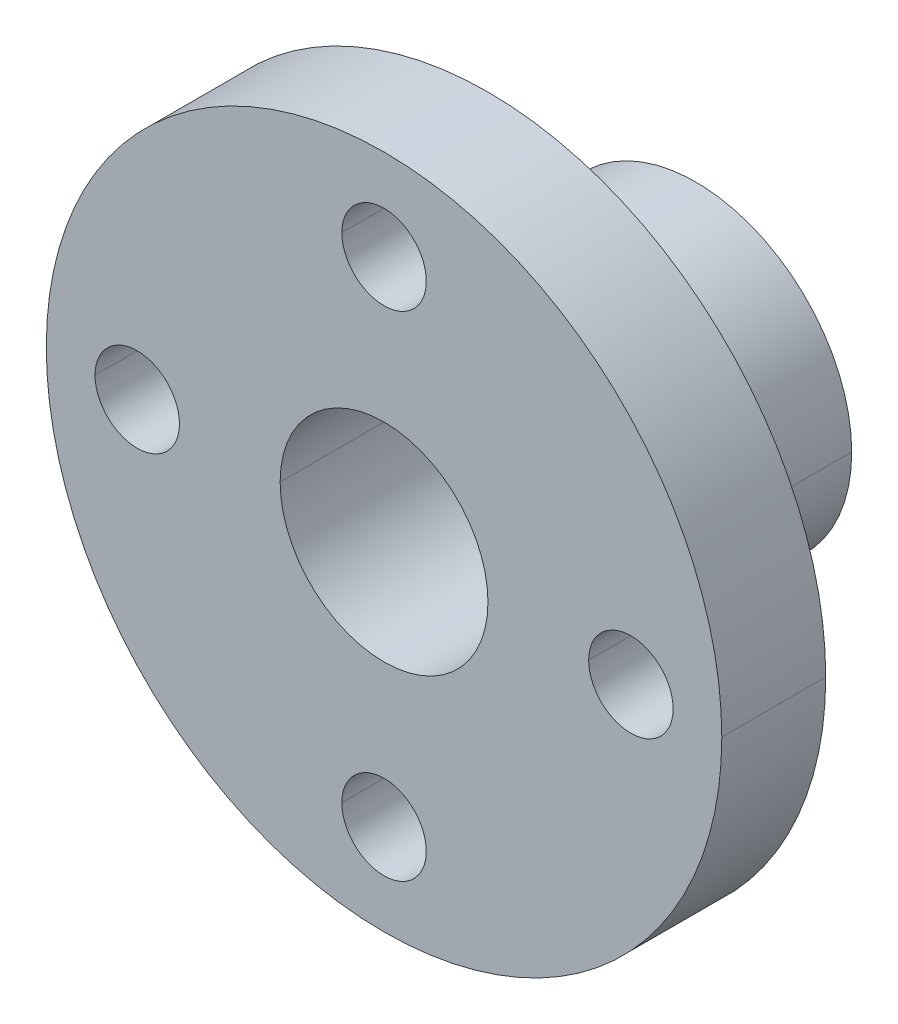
ISO-10303-21;
HEADER;
FILE_DESCRIPTION(('STEP AP214'),'2;1');
FILE_NAME('part.step','',(''),(''),'','','');
FILE_SCHEMA(('AUTOMOTIVE_DESIGN { 1 0 10303 214 1 1 1 1 }'));
ENDSEC;
DATA;
#1=APPLICATION_CONTEXT('core data for automotive mechanical design processes');
#2=APPLICATION_PROTOCOL_DEFINITION('international standard','automotive_design',2000,#1);
#3=PRODUCT_CONTEXT('',#1,'mechanical');
#4=PRODUCT('Part','Part','',(#3));
#5=PRODUCT_RELATED_PRODUCT_CATEGORY('part','',(#4));
#6=PRODUCT_DEFINITION_FORMATION('','',#4);
#7=PRODUCT_DEFINITION_CONTEXT('part definition',#1,'design');
#8=PRODUCT_DEFINITION('design','',#6,#7);
#9=PRODUCT_DEFINITION_SHAPE('','',#8);
#10=(LENGTH_UNIT() NAMED_UNIT(*) SI_UNIT(.MILLI.,.METRE.));
#11=(NAMED_UNIT(*) PLANE_ANGLE_UNIT() SI_UNIT($,.RADIAN.));
#12=(NAMED_UNIT(*) SI_UNIT($,.STERADIAN.) SOLID_ANGLE_UNIT());
#13=UNCERTAINTY_MEASURE_WITH_UNIT(LENGTH_MEASURE(1.E-05),#10,'distance_accuracy_value','');
#14=(GEOMETRIC_REPRESENTATION_CONTEXT(3) GLOBAL_UNCERTAINTY_ASSIGNED_CONTEXT((#13)) GLOBAL_UNIT_ASSIGNED_CONTEXT((#10,
#11,#12)) REPRESENTATION_CONTEXT('',''));
#15=CARTESIAN_POINT('',(0.,0.,0.));
#16=DIRECTION('',(0.,0.,1.));
#17=DIRECTION('',(1.,0.,0.));
#18=AXIS2_PLACEMENT_3D('',#15,#16,#17);
#19=CARTESIAN_POINT('',(0.,0.,-6.35000000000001));
#20=DIRECTION('',(0.,0.,-1.));
#21=DIRECTION('',(0.,1.,0.));
#22=AXIS2_PLACEMENT_3D('',#19,#20,#21);
#23=CYLINDRICAL_SURFACE('',#22,19.05);
#24=DIRECTION('',(0.,0.,-1.));
#25=VECTOR('',#24,1.);
#26=CARTESIAN_POINT('',(19.05,0.,-6.35000000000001));
#27=LINE('',#26,#25);
#28=CARTESIAN_POINT('',(19.05,0.,6.34999999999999));
#29=VERTEX_POINT('',#28);
#30=CARTESIAN_POINT('',(19.05,0.,-19.05));
#31=VERTEX_POINT('',#30);
#32=EDGE_CURVE('E117',#29,#31,#27,.T.);
#33=ORIENTED_EDGE('',*,*,#32,.F.);
#34=CARTESIAN_POINT('',(0.,0.,6.34999999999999));
#35=DIRECTION('',(0.,0.,-1.));
#36=DIRECTION('',(0.,1.,0.));
#37=AXIS2_PLACEMENT_3D('',#34,#35,#36);
#38=CIRCLE('',#37,19.05);
#39=CARTESIAN_POINT('',(-19.05,0.,6.34999999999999));
#40=VERTEX_POINT('',#39);
#41=EDGE_CURVE('E130',#40,#29,#38,.F.);
#42=ORIENTED_EDGE('',*,*,#41,.F.);
#43=DIRECTION('',(0.,0.,-1.));
#44=VECTOR('',#43,1.);
#45=CARTESIAN_POINT('',(-19.05,0.,-6.35000000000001));
#46=LINE('',#45,#44);
#47=CARTESIAN_POINT('',(-19.05,0.,-19.05));
#48=VERTEX_POINT('',#47);
#49=EDGE_CURVE('E113',#48,#40,#46,.F.);
#50=ORIENTED_EDGE('',*,*,#49,.F.);
#51=CARTESIAN_POINT('',(0.,0.,-19.05));
#52=DIRECTION('',(0.,0.,-1.));
#53=DIRECTION('',(0.,1.,0.));
#54=AXIS2_PLACEMENT_3D('',#51,#52,#53);
#55=CIRCLE('',#54,19.05);
#56=EDGE_CURVE('E19',#48,#31,#55,.F.);
#57=ORIENTED_EDGE('',*,*,#56,.T.);
#58=EDGE_LOOP('',(#33,#42,#50,#57));
#59=FACE_BOUND('',#58,.T.);
#60=ADVANCED_FACE('F16',(#59),#23,.T.);
#61=CARTESIAN_POINT('',(0.,0.,-6.35000000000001));
#62=DIRECTION('',(0.,0.,-1.));
#63=DIRECTION('',(0.,1.,0.));
#64=AXIS2_PLACEMENT_3D('',#61,#62,#63);
#65=CYLINDRICAL_SURFACE('',#64,19.05);
#66=ORIENTED_EDGE('',*,*,#32,.T.);
#67=CARTESIAN_POINT('',(0.,0.,-19.05));
#68=DIRECTION('',(0.,0.,-1.));
#69=DIRECTION('',(0.,1.,0.));
#70=AXIS2_PLACEMENT_3D('',#67,#68,#69);
#71=CIRCLE('',#70,19.05);
#72=EDGE_CURVE('E121',#31,#48,#71,.F.);
#73=ORIENTED_EDGE('',*,*,#72,.T.);
#74=ORIENTED_EDGE('',*,*,#49,.T.);
#75=CARTESIAN_POINT('',(0.,0.,6.34999999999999));
#76=DIRECTION('',(0.,0.,-1.));
#77=DIRECTION('',(0.,1.,0.));
#78=AXIS2_PLACEMENT_3D('',#75,#76,#77);
#79=CIRCLE('',#78,19.05);
#80=EDGE_CURVE('E125',#29,#40,#79,.F.);
#81=ORIENTED_EDGE('',*,*,#80,.F.);
#82=EDGE_LOOP('',(#66,#73,#74,#81));
#83=FACE_BOUND('',#82,.T.);
#84=ADVANCED_FACE('F123',(#83),#65,.T.);
#85=CARTESIAN_POINT('',(0.,0.,-19.05));
#86=DIRECTION('',(0.,0.,1.));
#87=DIRECTION('',(0.,-1.,0.));
#88=AXIS2_PLACEMENT_3D('',#85,#86,#87);
#89=PLANE('',#88);
#90=ORIENTED_EDGE('',*,*,#56,.F.);
#91=ORIENTED_EDGE('',*,*,#72,.F.);
#92=EDGE_LOOP('',(#90,#91));
#93=FACE_BOUND('',#92,.T.);
#94=CARTESIAN_POINT('',(0.,0.,-19.05));
#95=DIRECTION('',(0.,0.,1.));
#96=DIRECTION('',(0.,-1.,0.));
#97=AXIS2_PLACEMENT_3D('',#94,#95,#96);
#98=CIRCLE('',#97,12.7);
#99=CARTESIAN_POINT('',(-12.7,0.,-19.05));
#100=VERTEX_POINT('',#99);
#101=CARTESIAN_POINT('',(12.7,0.,-19.05));
#102=VERTEX_POINT('',#101);
#103=EDGE_CURVE('E137',#100,#102,#98,.T.);
#104=ORIENTED_EDGE('',*,*,#103,.T.);
#105=CARTESIAN_POINT('',(0.,0.,-19.05));
#106=DIRECTION('',(0.,0.,1.));
#107=DIRECTION('',(0.,-1.,0.));
#108=AXIS2_PLACEMENT_3D('',#105,#106,#107);
#109=CIRCLE('',#108,12.7);
#110=EDGE_CURVE('E134',#102,#100,#109,.T.);
#111=ORIENTED_EDGE('',*,*,#110,.T.);
#112=EDGE_LOOP('',(#104,#111));
#113=FACE_BOUND('',#112,.T.);
#114=ADVANCED_FACE('F128',(#93,#113),#89,.F.);
#115=CARTESIAN_POINT('',(0.,0.,6.34999999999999));
#116=DIRECTION('',(0.,0.,-1.));
#117=DIRECTION('',(0.,1.,0.));
#118=AXIS2_PLACEMENT_3D('',#115,#116,#117);
#119=PLANE('',#118);
#120=ORIENTED_EDGE('',*,*,#41,.T.);
#121=ORIENTED_EDGE('',*,*,#80,.T.);
#122=EDGE_LOOP('',(#120,#121));
#123=FACE_BOUND('',#122,.T.);
#124=CARTESIAN_POINT('',(0.,0.,6.34999999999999));
#125=DIRECTION('',(0.,0.,1.));
#126=DIRECTION('',(0.,-1.,0.));
#127=AXIS2_PLACEMENT_3D('',#124,#125,#126);
#128=CIRCLE('',#127,41.275);
#129=CARTESIAN_POINT('',(-41.275,0.,6.34999999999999));
#130=VERTEX_POINT('',#129);
#131=CARTESIAN_POINT('',(41.275,0.,6.34999999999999));
#132=VERTEX_POINT('',#131);
#133=EDGE_CURVE('E167',#130,#132,#128,.T.);
#134=ORIENTED_EDGE('',*,*,#133,.F.);
#135=CARTESIAN_POINT('',(0.,0.,6.34999999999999));
#136=DIRECTION('',(0.,0.,1.));
#137=DIRECTION('',(0.,-1.,0.));
#138=AXIS2_PLACEMENT_3D('',#135,#136,#137);
#139=CIRCLE('',#138,41.275);
#140=EDGE_CURVE('E163',#132,#130,#139,.T.);
#141=ORIENTED_EDGE('',*,*,#140,.F.);
#142=EDGE_LOOP('',(#134,#141));
#143=FACE_BOUND('',#142,.T.);
#144=CARTESIAN_POINT('',(-30.1625,0.,6.34999999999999));
#145=DIRECTION('',(0.,0.,1.));
#146=DIRECTION('',(0.,-1.,0.));
#147=AXIS2_PLACEMENT_3D('',#144,#145,#146);
#148=CIRCLE('',#147,5.159375);
#149=CARTESIAN_POINT('',(-25.003125,0.,6.34999999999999));
#150=VERTEX_POINT('',#149);
#151=CARTESIAN_POINT('',(-35.321875,0.,6.34999999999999));
#152=VERTEX_POINT('',#151);
#153=EDGE_CURVE('E159',#150,#152,#148,.T.);
#154=ORIENTED_EDGE('',*,*,#153,.T.);
#155=CARTESIAN_POINT('',(-30.1625,0.,6.34999999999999));
#156=DIRECTION('',(0.,0.,1.));
#157=DIRECTION('',(0.,-1.,0.));
#158=AXIS2_PLACEMENT_3D('',#155,#156,#157);
#159=CIRCLE('',#158,5.159375);
#160=EDGE_CURVE('E157',#152,#150,#159,.T.);
#161=ORIENTED_EDGE('',*,*,#160,.T.);
#162=EDGE_LOOP('',(#154,#161));
#163=FACE_BOUND('',#162,.T.);
#164=CARTESIAN_POINT('',(0.,-30.1625,6.34999999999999));
#165=DIRECTION('',(0.,0.,1.));
#166=DIRECTION('',(0.,-1.,0.));
#167=AXIS2_PLACEMENT_3D('',#164,#165,#166);
#168=CIRCLE('',#167,5.159375);
#169=CARTESIAN_POINT('',(5.159375,-30.1625,6.34999999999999));
#170=VERTEX_POINT('',#169);
#171=CARTESIAN_POINT('',(-5.159375,-30.1625,6.34999999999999));
#172=VERTEX_POINT('',#171);
#173=EDGE_CURVE('E153',#170,#172,#168,.T.);
#174=ORIENTED_EDGE('',*,*,#173,.T.);
#175=CARTESIAN_POINT('',(0.,-30.1625,6.34999999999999));
#176=DIRECTION('',(0.,0.,1.));
#177=DIRECTION('',(0.,-1.,0.));
#178=AXIS2_PLACEMENT_3D('',#175,#176,#177);
#179=CIRCLE('',#178,5.159375);
#180=EDGE_CURVE('E151',#172,#170,#179,.T.);
#181=ORIENTED_EDGE('',*,*,#180,.T.);
#182=EDGE_LOOP('',(#174,#181));
#183=FACE_BOUND('',#182,.T.);
#184=CARTESIAN_POINT('',(30.1625,0.,6.34999999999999));
#185=DIRECTION('',(0.,0.,1.));
#186=DIRECTION('',(0.,-1.,0.));
#187=AXIS2_PLACEMENT_3D('',#184,#185,#186);
#188=CIRCLE('',#187,5.159375);
#189=CARTESIAN_POINT('',(35.321875,0.,6.34999999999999));
#190=VERTEX_POINT('',#189);
#191=CARTESIAN_POINT('',(25.003125,0.,6.34999999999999));
#192=VERTEX_POINT('',#191);
#193=EDGE_CURVE('E147',#190,#192,#188,.T.);
#194=ORIENTED_EDGE('',*,*,#193,.T.);
#195=CARTESIAN_POINT('',(30.1625,0.,6.34999999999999));
#196=DIRECTION('',(0.,0.,1.));
#197=DIRECTION('',(0.,-1.,0.));
#198=AXIS2_PLACEMENT_3D('',#195,#196,#197);
#199=CIRCLE('',#198,5.159375);
#200=EDGE_CURVE('E145',#192,#190,#199,.T.);
#201=ORIENTED_EDGE('',*,*,#200,.T.);
#202=EDGE_LOOP('',(#194,#201));
#203=FACE_BOUND('',#202,.T.);
#204=CARTESIAN_POINT('',(0.,30.1625,6.34999999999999));
#205=DIRECTION('',(0.,0.,1.));
#206=DIRECTION('',(0.,-1.,0.));
#207=AXIS2_PLACEMENT_3D('',#204,#205,#206);
#208=CIRCLE('',#207,5.159375);
#209=CARTESIAN_POINT('',(5.159375,30.1625,6.34999999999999));
#210=VERTEX_POINT('',#209);
#211=CARTESIAN_POINT('',(-5.159375,30.1625,6.34999999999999));
#212=VERTEX_POINT('',#211);
#213=EDGE_CURVE('E142',#210,#212,#208,.T.);
#214=ORIENTED_EDGE('',*,*,#213,.T.);
#215=CARTESIAN_POINT('',(0.,30.1625,6.34999999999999));
#216=DIRECTION('',(0.,0.,1.));
#217=DIRECTION('',(0.,-1.,0.));
#218=AXIS2_PLACEMENT_3D('',#215,#216,#217);
#219=CIRCLE('',#218,5.159375);
#220=EDGE_CURVE('E140',#212,#210,#219,.T.);
#221=ORIENTED_EDGE('',*,*,#220,.T.);
#222=EDGE_LOOP('',(#214,#221));
#223=FACE_BOUND('',#222,.T.);
#224=ADVANCED_FACE('F330',(#123,#143,#163,#183,#203,#223),#119,.T.);
#225=CARTESIAN_POINT('',(0.,0.,19.05));
#226=DIRECTION('',(0.,0.,1.));
#227=DIRECTION('',(0.,-1.,0.));
#228=AXIS2_PLACEMENT_3D('',#225,#226,#227);
#229=CYLINDRICAL_SURFACE('',#228,12.7);
#230=CARTESIAN_POINT('',(0.,0.,19.05));
#231=DIRECTION('',(0.,0.,1.));
#232=DIRECTION('',(0.,-1.,0.));
#233=AXIS2_PLACEMENT_3D('',#230,#231,#232);
#234=CIRCLE('',#233,12.7);
#235=CARTESIAN_POINT('',(-12.7,0.,19.05));
#236=VERTEX_POINT('',#235);
#237=CARTESIAN_POINT('',(12.7,0.,19.05));
#238=VERTEX_POINT('',#237);
#239=EDGE_CURVE('E170',#236,#238,#234,.F.);
#240=ORIENTED_EDGE('',*,*,#239,.F.);
#241=DIRECTION('',(0.,0.,1.));
#242=VECTOR('',#241,1.);
#243=CARTESIAN_POINT('',(-12.7,0.,19.05));
#244=LINE('',#243,#242);
#245=EDGE_CURVE('E136',#236,#100,#244,.F.);
#246=ORIENTED_EDGE('',*,*,#245,.T.);
#247=ORIENTED_EDGE('',*,*,#110,.F.);
#248=DIRECTION('',(0.,0.,1.));
#249=VECTOR('',#248,1.);
#250=CARTESIAN_POINT('',(12.7,0.,19.05));
#251=LINE('',#250,#249);
#252=EDGE_CURVE('E139',#102,#238,#251,.T.);
#253=ORIENTED_EDGE('',*,*,#252,.T.);
#254=EDGE_LOOP('',(#240,#246,#247,#253));
#255=FACE_BOUND('',#254,.T.);
#256=ADVANCED_FACE('F322',(#255),#229,.F.);
#257=CARTESIAN_POINT('',(0.,0.,19.05));
#258=DIRECTION('',(0.,0.,1.));
#259=DIRECTION('',(0.,-1.,0.));
#260=AXIS2_PLACEMENT_3D('',#257,#258,#259);
#261=CYLINDRICAL_SURFACE('',#260,12.7);
#262=ORIENTED_EDGE('',*,*,#103,.F.);
#263=ORIENTED_EDGE('',*,*,#245,.F.);
#264=CARTESIAN_POINT('',(0.,0.,19.05));
#265=DIRECTION('',(0.,0.,1.));
#266=DIRECTION('',(0.,-1.,0.));
#267=AXIS2_PLACEMENT_3D('',#264,#265,#266);
#268=CIRCLE('',#267,12.7);
#269=EDGE_CURVE('E173',#238,#236,#268,.F.);
#270=ORIENTED_EDGE('',*,*,#269,.F.);
#271=ORIENTED_EDGE('',*,*,#252,.F.);
#272=EDGE_LOOP('',(#262,#263,#270,#271));
#273=FACE_BOUND('',#272,.T.);
#274=ADVANCED_FACE('F314',(#273),#261,.F.);
#275=CARTESIAN_POINT('',(0.,30.1625,12.7));
#276=DIRECTION('',(0.,0.,1.));
#277=DIRECTION('',(0.,-1.,0.));
#278=AXIS2_PLACEMENT_3D('',#275,#276,#277);
#279=CYLINDRICAL_SURFACE('',#278,5.159375);
#280=ORIENTED_EDGE('',*,*,#220,.F.);
#281=DIRECTION('',(0.,0.,1.));
#282=VECTOR('',#281,1.);
#283=CARTESIAN_POINT('',(-5.159375,30.1625,12.7));
#284=LINE('',#283,#282);
#285=CARTESIAN_POINT('',(-5.159375,30.1625,19.05));
#286=VERTEX_POINT('',#285);
#287=EDGE_CURVE('E144',#212,#286,#284,.T.);
#288=ORIENTED_EDGE('',*,*,#287,.T.);
#289=CARTESIAN_POINT('',(0.,30.1625,19.05));
#290=DIRECTION('',(0.,0.,1.));
#291=DIRECTION('',(0.,-1.,0.));
#292=AXIS2_PLACEMENT_3D('',#289,#290,#291);
#293=CIRCLE('',#292,5.159375);
#294=CARTESIAN_POINT('',(5.159375,30.1625,19.05));
#295=VERTEX_POINT('',#294);
#296=EDGE_CURVE('E176',#295,#286,#293,.F.);
#297=ORIENTED_EDGE('',*,*,#296,.F.);
#298=DIRECTION('',(0.,0.,1.));
#299=VECTOR('',#298,1.);
#300=CARTESIAN_POINT('',(5.159375,30.1625,12.7));
#301=LINE('',#300,#299);
#302=EDGE_CURVE('E148',#295,#210,#301,.F.);
#303=ORIENTED_EDGE('',*,*,#302,.T.);
#304=EDGE_LOOP('',(#280,#288,#297,#303));
#305=FACE_BOUND('',#304,.T.);
#306=ADVANCED_FACE('F306',(#305),#279,.F.);
#307=CARTESIAN_POINT('',(0.,30.1625,12.7));
#308=DIRECTION('',(0.,0.,1.));
#309=DIRECTION('',(0.,-1.,0.));
#310=AXIS2_PLACEMENT_3D('',#307,#308,#309);
#311=CYLINDRICAL_SURFACE('',#310,5.159375);
#312=CARTESIAN_POINT('',(0.,30.1625,19.05));
#313=DIRECTION('',(0.,0.,1.));
#314=DIRECTION('',(0.,-1.,0.));
#315=AXIS2_PLACEMENT_3D('',#312,#313,#314);
#316=CIRCLE('',#315,5.159375);
#317=EDGE_CURVE('E179',#286,#295,#316,.F.);
#318=ORIENTED_EDGE('',*,*,#317,.F.);
#319=ORIENTED_EDGE('',*,*,#287,.F.);
#320=ORIENTED_EDGE('',*,*,#213,.F.);
#321=ORIENTED_EDGE('',*,*,#302,.F.);
#322=EDGE_LOOP('',(#318,#319,#320,#321));
#323=FACE_BOUND('',#322,.T.);
#324=ADVANCED_FACE('F298',(#323),#311,.F.);
#325=CARTESIAN_POINT('',(30.1625,0.,12.7));
#326=DIRECTION('',(0.,0.,1.));
#327=DIRECTION('',(0.,-1.,0.));
#328=AXIS2_PLACEMENT_3D('',#325,#326,#327);
#329=CYLINDRICAL_SURFACE('',#328,5.159375);
#330=ORIENTED_EDGE('',*,*,#200,.F.);
#331=DIRECTION('',(0.,0.,1.));
#332=VECTOR('',#331,1.);
#333=CARTESIAN_POINT('',(25.003125,0.,12.7));
#334=LINE('',#333,#332);
#335=CARTESIAN_POINT('',(25.003125,0.,19.05));
#336=VERTEX_POINT('',#335);
#337=EDGE_CURVE('E150',#192,#336,#334,.T.);
#338=ORIENTED_EDGE('',*,*,#337,.T.);
#339=CARTESIAN_POINT('',(30.1625,0.,19.05));
#340=DIRECTION('',(0.,0.,1.));
#341=DIRECTION('',(0.,-1.,0.));
#342=AXIS2_PLACEMENT_3D('',#339,#340,#341);
#343=CIRCLE('',#342,5.159375);
#344=CARTESIAN_POINT('',(35.321875,0.,19.05));
#345=VERTEX_POINT('',#344);
#346=EDGE_CURVE('E182',#345,#336,#343,.F.);
#347=ORIENTED_EDGE('',*,*,#346,.F.);
#348=DIRECTION('',(0.,0.,1.));
#349=VECTOR('',#348,1.);
#350=CARTESIAN_POINT('',(35.321875,0.,12.7));
#351=LINE('',#350,#349);
#352=EDGE_CURVE('E154',#345,#190,#351,.F.);
#353=ORIENTED_EDGE('',*,*,#352,.T.);
#354=EDGE_LOOP('',(#330,#338,#347,#353));
#355=FACE_BOUND('',#354,.T.);
#356=ADVANCED_FACE('F290',(#355),#329,.F.);
#357=CARTESIAN_POINT('',(30.1625,0.,12.7));
#358=DIRECTION('',(0.,0.,1.));
#359=DIRECTION('',(0.,-1.,0.));
#360=AXIS2_PLACEMENT_3D('',#357,#358,#359);
#361=CYLINDRICAL_SURFACE('',#360,5.159375);
#362=CARTESIAN_POINT('',(30.1625,0.,19.05));
#363=DIRECTION('',(0.,0.,1.));
#364=DIRECTION('',(0.,-1.,0.));
#365=AXIS2_PLACEMENT_3D('',#362,#363,#364);
#366=CIRCLE('',#365,5.159375);
#367=EDGE_CURVE('E185',#336,#345,#366,.F.);
#368=ORIENTED_EDGE('',*,*,#367,.F.);
#369=ORIENTED_EDGE('',*,*,#337,.F.);
#370=ORIENTED_EDGE('',*,*,#193,.F.);
#371=ORIENTED_EDGE('',*,*,#352,.F.);
#372=EDGE_LOOP('',(#368,#369,#370,#371));
#373=FACE_BOUND('',#372,.T.);
#374=ADVANCED_FACE('F282',(#373),#361,.F.);
#375=CARTESIAN_POINT('',(0.,-30.1625,12.7));
#376=DIRECTION('',(0.,0.,1.));
#377=DIRECTION('',(0.,-1.,0.));
#378=AXIS2_PLACEMENT_3D('',#375,#376,#377);
#379=CYLINDRICAL_SURFACE('',#378,5.159375);
#380=ORIENTED_EDGE('',*,*,#180,.F.);
#381=DIRECTION('',(0.,0.,1.));
#382=VECTOR('',#381,1.);
#383=CARTESIAN_POINT('',(-5.159375,-30.1625,12.7));
#384=LINE('',#383,#382);
#385=CARTESIAN_POINT('',(-5.159375,-30.1625,19.05));
#386=VERTEX_POINT('',#385);
#387=EDGE_CURVE('E156',#172,#386,#384,.T.);
#388=ORIENTED_EDGE('',*,*,#387,.T.);
#389=CARTESIAN_POINT('',(0.,-30.1625,19.05));
#390=DIRECTION('',(0.,0.,1.));
#391=DIRECTION('',(0.,-1.,0.));
#392=AXIS2_PLACEMENT_3D('',#389,#390,#391);
#393=CIRCLE('',#392,5.159375);
#394=CARTESIAN_POINT('',(5.159375,-30.1625,19.05));
#395=VERTEX_POINT('',#394);
#396=EDGE_CURVE('E188',#395,#386,#393,.F.);
#397=ORIENTED_EDGE('',*,*,#396,.F.);
#398=DIRECTION('',(0.,0.,1.));
#399=VECTOR('',#398,1.);
#400=CARTESIAN_POINT('',(5.159375,-30.1625,12.7));
#401=LINE('',#400,#399);
#402=EDGE_CURVE('E160',#395,#170,#401,.F.);
#403=ORIENTED_EDGE('',*,*,#402,.T.);
#404=EDGE_LOOP('',(#380,#388,#397,#403));
#405=FACE_BOUND('',#404,.T.);
#406=ADVANCED_FACE('F274',(#405),#379,.F.);
#407=CARTESIAN_POINT('',(0.,-30.1625,12.7));
#408=DIRECTION('',(0.,0.,1.));
#409=DIRECTION('',(0.,-1.,0.));
#410=AXIS2_PLACEMENT_3D('',#407,#408,#409);
#411=CYLINDRICAL_SURFACE('',#410,5.159375);
#412=CARTESIAN_POINT('',(0.,-30.1625,19.05));
#413=DIRECTION('',(0.,0.,1.));
#414=DIRECTION('',(0.,-1.,0.));
#415=AXIS2_PLACEMENT_3D('',#412,#413,#414);
#416=CIRCLE('',#415,5.159375);
#417=EDGE_CURVE('E191',#386,#395,#416,.F.);
#418=ORIENTED_EDGE('',*,*,#417,.F.);
#419=ORIENTED_EDGE('',*,*,#387,.F.);
#420=ORIENTED_EDGE('',*,*,#173,.F.);
#421=ORIENTED_EDGE('',*,*,#402,.F.);
#422=EDGE_LOOP('',(#418,#419,#420,#421));
#423=FACE_BOUND('',#422,.T.);
#424=ADVANCED_FACE('F266',(#423),#411,.F.);
#425=CARTESIAN_POINT('',(-30.1625,0.,12.7));
#426=DIRECTION('',(0.,0.,1.));
#427=DIRECTION('',(0.,-1.,0.));
#428=AXIS2_PLACEMENT_3D('',#425,#426,#427);
#429=CYLINDRICAL_SURFACE('',#428,5.159375);
#430=ORIENTED_EDGE('',*,*,#160,.F.);
#431=DIRECTION('',(0.,0.,1.));
#432=VECTOR('',#431,1.);
#433=CARTESIAN_POINT('',(-35.321875,0.,12.7));
#434=LINE('',#433,#432);
#435=CARTESIAN_POINT('',(-35.321875,0.,19.05));
#436=VERTEX_POINT('',#435);
#437=EDGE_CURVE('E162',#152,#436,#434,.T.);
#438=ORIENTED_EDGE('',*,*,#437,.T.);
#439=CARTESIAN_POINT('',(-30.1625,0.,19.05));
#440=DIRECTION('',(0.,0.,1.));
#441=DIRECTION('',(0.,-1.,0.));
#442=AXIS2_PLACEMENT_3D('',#439,#440,#441);
#443=CIRCLE('',#442,5.159375);
#444=CARTESIAN_POINT('',(-25.003125,0.,19.05));
#445=VERTEX_POINT('',#444);
#446=EDGE_CURVE('E194',#445,#436,#443,.F.);
#447=ORIENTED_EDGE('',*,*,#446,.F.);
#448=DIRECTION('',(0.,0.,1.));
#449=VECTOR('',#448,1.);
#450=CARTESIAN_POINT('',(-25.003125,0.,12.7));
#451=LINE('',#450,#449);
#452=EDGE_CURVE('E166',#445,#150,#451,.F.);
#453=ORIENTED_EDGE('',*,*,#452,.T.);
#454=EDGE_LOOP('',(#430,#438,#447,#453));
#455=FACE_BOUND('',#454,.T.);
#456=ADVANCED_FACE('F237',(#455),#429,.F.);
#457=CARTESIAN_POINT('',(-30.1625,0.,12.7));
#458=DIRECTION('',(0.,0.,1.));
#459=DIRECTION('',(0.,-1.,0.));
#460=AXIS2_PLACEMENT_3D('',#457,#458,#459);
#461=CYLINDRICAL_SURFACE('',#460,5.159375);
#462=CARTESIAN_POINT('',(-30.1625,0.,19.05));
#463=DIRECTION('',(0.,0.,1.));
#464=DIRECTION('',(0.,-1.,0.));
#465=AXIS2_PLACEMENT_3D('',#462,#463,#464);
#466=CIRCLE('',#465,5.159375);
#467=EDGE_CURVE('E197',#436,#445,#466,.F.);
#468=ORIENTED_EDGE('',*,*,#467,.F.);
#469=ORIENTED_EDGE('',*,*,#437,.F.);
#470=ORIENTED_EDGE('',*,*,#153,.F.);
#471=ORIENTED_EDGE('',*,*,#452,.F.);
#472=EDGE_LOOP('',(#468,#469,#470,#471));
#473=FACE_BOUND('',#472,.T.);
#474=ADVANCED_FACE('F229',(#473),#461,.F.);
#475=CARTESIAN_POINT('',(0.,0.,12.7));
#476=DIRECTION('',(0.,0.,1.));
#477=DIRECTION('',(0.,-1.,0.));
#478=AXIS2_PLACEMENT_3D('',#475,#476,#477);
#479=CYLINDRICAL_SURFACE('',#478,41.275);
#480=DIRECTION('',(0.,0.,1.));
#481=VECTOR('',#480,1.);
#482=CARTESIAN_POINT('',(-41.275,0.,12.7));
#483=LINE('',#482,#481);
#484=CARTESIAN_POINT('',(-41.275,0.,19.05));
#485=VERTEX_POINT('',#484);
#486=EDGE_CURVE('E34',#485,#130,#483,.F.);
#487=ORIENTED_EDGE('',*,*,#486,.F.);
#488=CARTESIAN_POINT('',(0.,0.,19.05));
#489=DIRECTION('',(0.,0.,1.));
#490=DIRECTION('',(0.,-1.,0.));
#491=AXIS2_PLACEMENT_3D('',#488,#489,#490);
#492=CIRCLE('',#491,41.275);
#493=CARTESIAN_POINT('',(41.275,0.,19.05));
#494=VERTEX_POINT('',#493);
#495=EDGE_CURVE('E25',#494,#485,#492,.T.);
#496=ORIENTED_EDGE('',*,*,#495,.F.);
#497=DIRECTION('',(0.,0.,1.));
#498=VECTOR('',#497,1.);
#499=CARTESIAN_POINT('',(41.275,0.,12.7));
#500=LINE('',#499,#498);
#501=EDGE_CURVE('E165',#132,#494,#500,.T.);
#502=ORIENTED_EDGE('',*,*,#501,.F.);
#503=ORIENTED_EDGE('',*,*,#140,.T.);
#504=EDGE_LOOP('',(#487,#496,#502,#503));
#505=FACE_BOUND('',#504,.T.);
#506=ADVANCED_FACE('F227',(#505),#479,.T.);
#507=CARTESIAN_POINT('',(0.,0.,12.7));
#508=DIRECTION('',(0.,0.,1.));
#509=DIRECTION('',(0.,-1.,0.));
#510=AXIS2_PLACEMENT_3D('',#507,#508,#509);
#511=CYLINDRICAL_SURFACE('',#510,41.275);
#512=ORIENTED_EDGE('',*,*,#486,.T.);
#513=ORIENTED_EDGE('',*,*,#133,.T.);
#514=ORIENTED_EDGE('',*,*,#501,.T.);
#515=CARTESIAN_POINT('',(0.,0.,19.05));
#516=DIRECTION('',(0.,0.,1.));
#517=DIRECTION('',(0.,-1.,0.));
#518=AXIS2_PLACEMENT_3D('',#515,#516,#517);
#519=CIRCLE('',#518,41.275);
#520=EDGE_CURVE('E11',#485,#494,#519,.T.);
#521=ORIENTED_EDGE('',*,*,#520,.F.);
#522=EDGE_LOOP('',(#512,#513,#514,#521));
#523=FACE_BOUND('',#522,.T.);
#524=ADVANCED_FACE('F222',(#523),#511,.T.);
#525=CARTESIAN_POINT('',(0.,0.,19.05));
#526=DIRECTION('',(0.,0.,1.));
#527=DIRECTION('',(0.,-1.,0.));
#528=AXIS2_PLACEMENT_3D('',#525,#526,#527);
#529=PLANE('',#528);
#530=ORIENTED_EDGE('',*,*,#495,.T.);
#531=ORIENTED_EDGE('',*,*,#520,.T.);
#532=EDGE_LOOP('',(#530,#531));
#533=FACE_BOUND('',#532,.T.);
#534=ORIENTED_EDGE('',*,*,#446,.T.);
#535=ORIENTED_EDGE('',*,*,#467,.T.);
#536=EDGE_LOOP('',(#534,#535));
#537=FACE_BOUND('',#536,.T.);
#538=ORIENTED_EDGE('',*,*,#396,.T.);
#539=ORIENTED_EDGE('',*,*,#417,.T.);
#540=EDGE_LOOP('',(#538,#539));
#541=FACE_BOUND('',#540,.T.);
#542=ORIENTED_EDGE('',*,*,#346,.T.);
#543=ORIENTED_EDGE('',*,*,#367,.T.);
#544=EDGE_LOOP('',(#542,#543));
#545=FACE_BOUND('',#544,.T.);
#546=ORIENTED_EDGE('',*,*,#296,.T.);
#547=ORIENTED_EDGE('',*,*,#317,.T.);
#548=EDGE_LOOP('',(#546,#547));
#549=FACE_BOUND('',#548,.T.);
#550=ORIENTED_EDGE('',*,*,#239,.T.);
#551=ORIENTED_EDGE('',*,*,#269,.T.);
#552=EDGE_LOOP('',(#550,#551));
#553=FACE_BOUND('',#552,.T.);
#554=ADVANCED_FACE('F225',(#533,#537,#541,#545,#549,#553),#529,.T.);
#555=CLOSED_SHELL('',(#60,#84,#114,#224,#256,#274,#306,#324,#356,#374,#406,#424,#456,#474,#506,
#524,#554));
#556=MANIFOLD_SOLID_BREP('B1',#555);
#557=ADVANCED_BREP_SHAPE_REPRESENTATION('',(#18,#556),#14);
#558=SHAPE_DEFINITION_REPRESENTATION(#9,#557);
ENDSEC;
END-ISO-10303-21;
